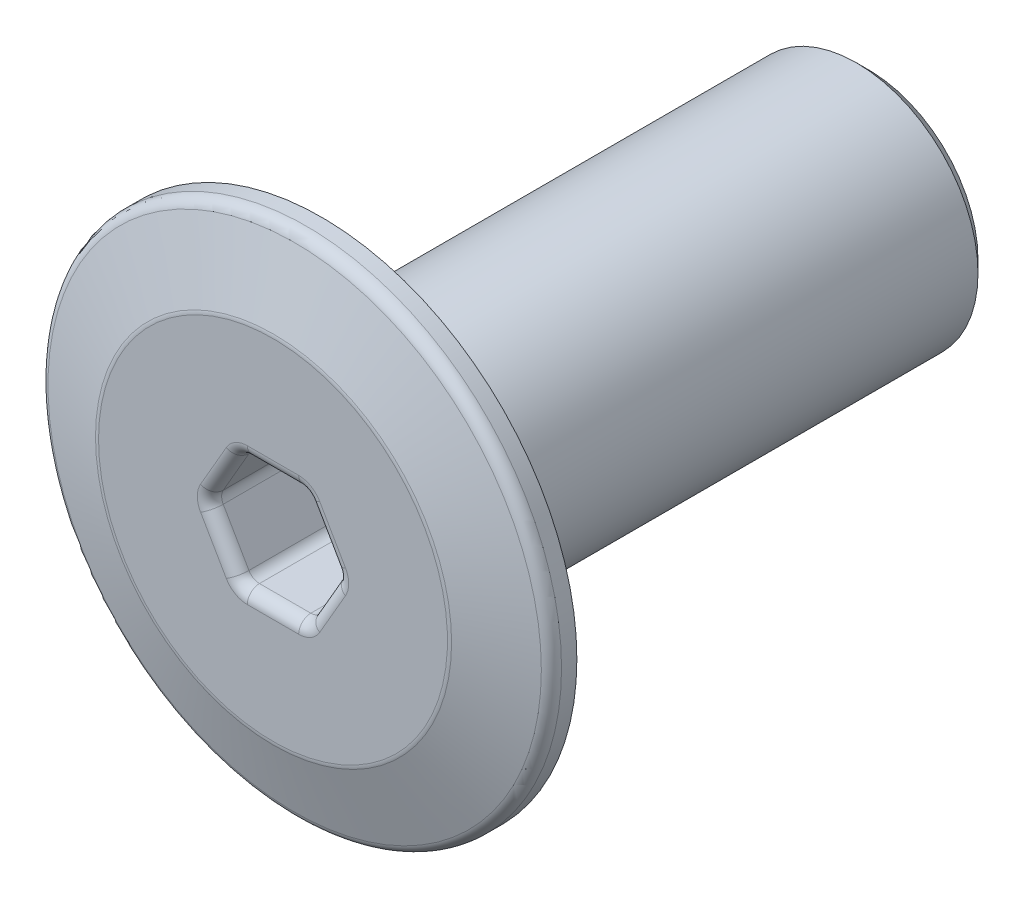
from build123d import *

# Parameters (mm, degrees)
CHANFREIN1_SIZE         = 0.5
ENL_V_MAT_EXTRU_2_DEPTH = 5
CONG_2_R                = 0.5
CONG_3_R                = 0.5


with BuildPart() as part:
    # Esquisse1 → R_volution1 (revolve)
    with BuildSketch(Plane(origin=(0, 0, 0), x_dir=(0, 0, -1), z_dir=(1, 0, 0)), mode=Mode.PRIVATE) as r_volution1_sk:
        Polygon((23.512820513, 0), (23.512820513, 5), (1.512820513, 5), (1.512820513, 6), (1.012820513, 6), (1.012820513, 10.5), (0.012820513, 10.5), (-0.987179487, 7.252136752), (-0.987179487, 0), align=None)
    revolve(r_volution1_sk.sketch.rotate(Axis((0, 0, 0), (0, 0, -1)), 90), axis=Axis((0, 0, 0), (0, 0, -1)))

    # Chanfrein1
    chanfrein1_edges = [part.edges().sort_by_distance(p)[0] for p in [
        (-5, 0, -23.512820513),
    ]]
    chamfer(chanfrein1_edges, length=CHANFREIN1_SIZE)

    # Esquisse2 → Enl_v. mat.-Extru.2 (cut)
    with BuildSketch(Plane.XY.offset(0.987179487)):
        Polygon((-2.690598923, 0), (-1.345299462, 2.330127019), (1.345299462, 2.330127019), (2.690598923, 0), (1.345299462, -2.330127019), (-1.345299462, -2.330127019), align=None)
    extrude(amount=-ENL_V_MAT_EXTRU_2_DEPTH, mode=Mode.SUBTRACT)

    # Cong_2
    cong_2_edges = [part.edges().sort_by_distance(p)[0] for p in [
        (-2.017949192, -1.165063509, -4.012820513),
        (-2.017949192, 1.165063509, -4.012820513),
        (0, 2.330127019, -4.012820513),
        (2.017949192, 1.165063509, -4.012820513),
        (2.017949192, -1.165063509, -4.012820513),
        (0, -2.330127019, -4.012820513),
    ]]
    fillet(cong_2_edges, radius=CONG_2_R)

    # Cong_3
    cong_3_edges = [part.edges().sort_by_distance(p)[0] for p in [
        (-2.017949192, -1.165063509, 0.987179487),
        (0, -2.330127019, 0.987179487),
        (2.017949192, -1.165063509, 0.987179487),
        (2.017949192, 1.165063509, 0.987179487),
        (0, 2.330127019, 0.987179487),
        (-2.017949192, 1.165063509, 0.987179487),
        (-1.345299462, 2.330127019, -1.262820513),
        (1.345299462, 2.330127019, -1.262820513),
        (-2.690598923, 0, -1.262820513),
        (-1.345299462, -2.330127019, -1.262820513),
        (1.345299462, -2.330127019, -1.262820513),
        (2.690598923, 0, -1.262820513),
        (-1.253335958, 2.170841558, -3.878762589),
        (-2.506671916, 0, -3.878762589),
        (-1.253335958, -2.170841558, -3.878762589),
        (1.253335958, -2.170841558, -3.878762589),
        (2.506671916, 0, -3.878762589),
        (1.253335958, 2.170841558, -3.878762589),
        (-7.252136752, 0, 0.987179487),
        (-10.5, 0, -0.012820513),
    ]]
    fillet(cong_3_edges, radius=CONG_3_R)


solid = part.part
